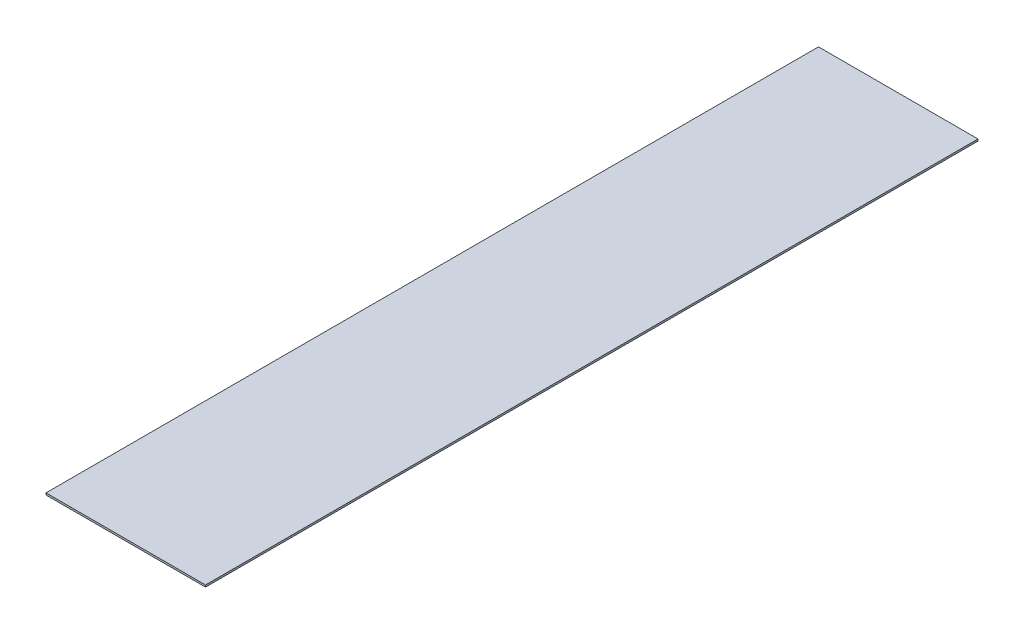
ISO-10303-21;
HEADER;
FILE_DESCRIPTION(('STEP AP214'),'2;1');
FILE_NAME('part.step','',(''),(''),'','','');
FILE_SCHEMA(('AUTOMOTIVE_DESIGN { 1 0 10303 214 1 1 1 1 }'));
ENDSEC;
DATA;
#1=APPLICATION_CONTEXT('core data for automotive mechanical design processes');
#2=APPLICATION_PROTOCOL_DEFINITION('international standard','automotive_design',2000,#1);
#3=PRODUCT_CONTEXT('',#1,'mechanical');
#4=PRODUCT('Part','Part','',(#3));
#5=PRODUCT_RELATED_PRODUCT_CATEGORY('part','',(#4));
#6=PRODUCT_DEFINITION_FORMATION('','',#4);
#7=PRODUCT_DEFINITION_CONTEXT('part definition',#1,'design');
#8=PRODUCT_DEFINITION('design','',#6,#7);
#9=PRODUCT_DEFINITION_SHAPE('','',#8);
#10=(LENGTH_UNIT() NAMED_UNIT(*) SI_UNIT(.MILLI.,.METRE.));
#11=(NAMED_UNIT(*) PLANE_ANGLE_UNIT() SI_UNIT($,.RADIAN.));
#12=(NAMED_UNIT(*) SI_UNIT($,.STERADIAN.) SOLID_ANGLE_UNIT());
#13=UNCERTAINTY_MEASURE_WITH_UNIT(LENGTH_MEASURE(1.E-05),#10,'distance_accuracy_value','');
#14=(GEOMETRIC_REPRESENTATION_CONTEXT(3) GLOBAL_UNCERTAINTY_ASSIGNED_CONTEXT((#13)) GLOBAL_UNIT_ASSIGNED_CONTEXT((#10,
#11,#12)) REPRESENTATION_CONTEXT('',''));
#15=CARTESIAN_POINT('',(0.,0.,0.));
#16=DIRECTION('',(0.,0.,1.));
#17=DIRECTION('',(1.,0.,0.));
#18=AXIS2_PLACEMENT_3D('',#15,#16,#17);
#19=CARTESIAN_POINT('',(267.49375,-6.35,-1295.4));
#20=DIRECTION('',(1.,0.,0.));
#21=DIRECTION('',(0.,0.,-1.));
#22=AXIS2_PLACEMENT_3D('',#19,#20,#21);
#23=PLANE('',#22);
#24=DIRECTION('',(0.,0.,-1.));
#25=VECTOR('',#24,1.);
#26=CARTESIAN_POINT('',(267.49375,0.,-1295.4));
#27=LINE('',#26,#25);
#28=CARTESIAN_POINT('',(267.49375,0.,1295.4));
#29=VERTEX_POINT('',#28);
#30=CARTESIAN_POINT('',(267.49375,0.,-1295.4));
#31=VERTEX_POINT('',#30);
#32=EDGE_CURVE('E100',#29,#31,#27,.T.);
#33=ORIENTED_EDGE('',*,*,#32,.F.);
#34=DIRECTION('',(0.,1.,0.));
#35=VECTOR('',#34,1.);
#36=CARTESIAN_POINT('',(267.49375,-6.35,1295.4));
#37=LINE('',#36,#35);
#38=CARTESIAN_POINT('',(267.49375,-6.35,1295.4));
#39=VERTEX_POINT('',#38);
#40=EDGE_CURVE('E11',#39,#29,#37,.T.);
#41=ORIENTED_EDGE('',*,*,#40,.F.);
#42=DIRECTION('',(0.,0.,-1.));
#43=VECTOR('',#42,1.);
#44=CARTESIAN_POINT('',(267.49375,-6.35,-1295.4));
#45=LINE('',#44,#43);
#46=CARTESIAN_POINT('',(267.49375,-6.35,-1295.4));
#47=VERTEX_POINT('',#46);
#48=EDGE_CURVE('E94',#39,#47,#45,.T.);
#49=ORIENTED_EDGE('',*,*,#48,.T.);
#50=DIRECTION('',(0.,1.,0.));
#51=VECTOR('',#50,1.);
#52=CARTESIAN_POINT('',(267.49375,-6.35,-1295.4));
#53=LINE('',#52,#51);
#54=EDGE_CURVE('E39',#47,#31,#53,.T.);
#55=ORIENTED_EDGE('',*,*,#54,.T.);
#56=EDGE_LOOP('',(#33,#41,#49,#55));
#57=FACE_BOUND('',#56,.T.);
#58=ADVANCED_FACE('F36',(#57),#23,.T.);
#59=CARTESIAN_POINT('',(-267.49375,-6.35,1295.4));
#60=DIRECTION('',(0.,0.,1.));
#61=DIRECTION('',(1.,0.,0.));
#62=AXIS2_PLACEMENT_3D('',#59,#60,#61);
#63=PLANE('',#62);
#64=DIRECTION('',(1.,0.,0.));
#65=VECTOR('',#64,1.);
#66=CARTESIAN_POINT('',(-267.49375,0.,1295.4));
#67=LINE('',#66,#65);
#68=CARTESIAN_POINT('',(-267.49375,0.,1295.4));
#69=VERTEX_POINT('',#68);
#70=EDGE_CURVE('E96',#69,#29,#67,.T.);
#71=ORIENTED_EDGE('',*,*,#70,.F.);
#72=DIRECTION('',(0.,1.,0.));
#73=VECTOR('',#72,1.);
#74=CARTESIAN_POINT('',(-267.49375,-6.35,1295.4));
#75=LINE('',#74,#73);
#76=CARTESIAN_POINT('',(-267.49375,-6.35,1295.4));
#77=VERTEX_POINT('',#76);
#78=EDGE_CURVE('E45',#77,#69,#75,.T.);
#79=ORIENTED_EDGE('',*,*,#78,.F.);
#80=DIRECTION('',(1.,0.,0.));
#81=VECTOR('',#80,1.);
#82=CARTESIAN_POINT('',(-267.49375,-6.35,1295.4));
#83=LINE('',#82,#81);
#84=EDGE_CURVE('E91',#77,#39,#83,.T.);
#85=ORIENTED_EDGE('',*,*,#84,.T.);
#86=ORIENTED_EDGE('',*,*,#40,.T.);
#87=EDGE_LOOP('',(#71,#79,#85,#86));
#88=FACE_BOUND('',#87,.T.);
#89=ADVANCED_FACE('F110',(#88),#63,.T.);
#90=CARTESIAN_POINT('',(-267.49375,-6.35,-1295.4));
#91=DIRECTION('',(-1.,0.,0.));
#92=DIRECTION('',(0.,0.,1.));
#93=AXIS2_PLACEMENT_3D('',#90,#91,#92);
#94=PLANE('',#93);
#95=DIRECTION('',(0.,0.,1.));
#96=VECTOR('',#95,1.);
#97=CARTESIAN_POINT('',(-267.49375,0.,-1295.4));
#98=LINE('',#97,#96);
#99=CARTESIAN_POINT('',(-267.49375,0.,-1295.4));
#100=VERTEX_POINT('',#99);
#101=EDGE_CURVE('E86',#100,#69,#98,.T.);
#102=ORIENTED_EDGE('',*,*,#101,.F.);
#103=DIRECTION('',(0.,1.,0.));
#104=VECTOR('',#103,1.);
#105=CARTESIAN_POINT('',(-267.49375,-6.35,-1295.4));
#106=LINE('',#105,#104);
#107=CARTESIAN_POINT('',(-267.49375,-6.35,-1295.4));
#108=VERTEX_POINT('',#107);
#109=EDGE_CURVE('E81',#108,#100,#106,.T.);
#110=ORIENTED_EDGE('',*,*,#109,.F.);
#111=DIRECTION('',(0.,0.,1.));
#112=VECTOR('',#111,1.);
#113=CARTESIAN_POINT('',(-267.49375,-6.35,-1295.4));
#114=LINE('',#113,#112);
#115=EDGE_CURVE('E84',#108,#77,#114,.T.);
#116=ORIENTED_EDGE('',*,*,#115,.T.);
#117=ORIENTED_EDGE('',*,*,#78,.T.);
#118=EDGE_LOOP('',(#102,#110,#116,#117));
#119=FACE_BOUND('',#118,.T.);
#120=ADVANCED_FACE('F83',(#119),#94,.T.);
#121=CARTESIAN_POINT('',(-267.49375,-6.35,-1295.4));
#122=DIRECTION('',(0.,0.,-1.));
#123=DIRECTION('',(-1.,0.,0.));
#124=AXIS2_PLACEMENT_3D('',#121,#122,#123);
#125=PLANE('',#124);
#126=DIRECTION('',(-1.,0.,0.));
#127=VECTOR('',#126,1.);
#128=CARTESIAN_POINT('',(-267.49375,0.,-1295.4));
#129=LINE('',#128,#127);
#130=EDGE_CURVE('E103',#31,#100,#129,.T.);
#131=ORIENTED_EDGE('',*,*,#130,.F.);
#132=ORIENTED_EDGE('',*,*,#54,.F.);
#133=DIRECTION('',(-1.,0.,0.));
#134=VECTOR('',#133,1.);
#135=CARTESIAN_POINT('',(-267.49375,-6.35,-1295.4));
#136=LINE('',#135,#134);
#137=EDGE_CURVE('E90',#47,#108,#136,.T.);
#138=ORIENTED_EDGE('',*,*,#137,.T.);
#139=ORIENTED_EDGE('',*,*,#109,.T.);
#140=EDGE_LOOP('',(#131,#132,#138,#139));
#141=FACE_BOUND('',#140,.T.);
#142=ADVANCED_FACE('F93',(#141),#125,.T.);
#143=CARTESIAN_POINT('',(267.49375,-6.35,1295.4));
#144=DIRECTION('',(0.,1.,0.));
#145=DIRECTION('',(0.,0.,1.));
#146=AXIS2_PLACEMENT_3D('',#143,#144,#145);
#147=PLANE('',#146);
#148=ORIENTED_EDGE('',*,*,#48,.F.);
#149=ORIENTED_EDGE('',*,*,#84,.F.);
#150=ORIENTED_EDGE('',*,*,#115,.F.);
#151=ORIENTED_EDGE('',*,*,#137,.F.);
#152=EDGE_LOOP('',(#148,#149,#150,#151));
#153=FACE_BOUND('',#152,.T.);
#154=ADVANCED_FACE('F89',(#153),#147,.F.);
#155=CARTESIAN_POINT('',(267.49375,0.,1295.4));
#156=DIRECTION('',(0.,1.,0.));
#157=DIRECTION('',(0.,0.,1.));
#158=AXIS2_PLACEMENT_3D('',#155,#156,#157);
#159=PLANE('',#158);
#160=ORIENTED_EDGE('',*,*,#32,.T.);
#161=ORIENTED_EDGE('',*,*,#130,.T.);
#162=ORIENTED_EDGE('',*,*,#101,.T.);
#163=ORIENTED_EDGE('',*,*,#70,.T.);
#164=EDGE_LOOP('',(#160,#161,#162,#163));
#165=FACE_BOUND('',#164,.T.);
#166=ADVANCED_FACE('F109',(#165),#159,.T.);
#167=CLOSED_SHELL('',(#58,#89,#120,#142,#154,#166));
#168=MANIFOLD_SOLID_BREP('B2',#167);
#169=ADVANCED_BREP_SHAPE_REPRESENTATION('',(#18,#168),#14);
#170=SHAPE_DEFINITION_REPRESENTATION(#9,#169);
ENDSEC;
END-ISO-10303-21;
